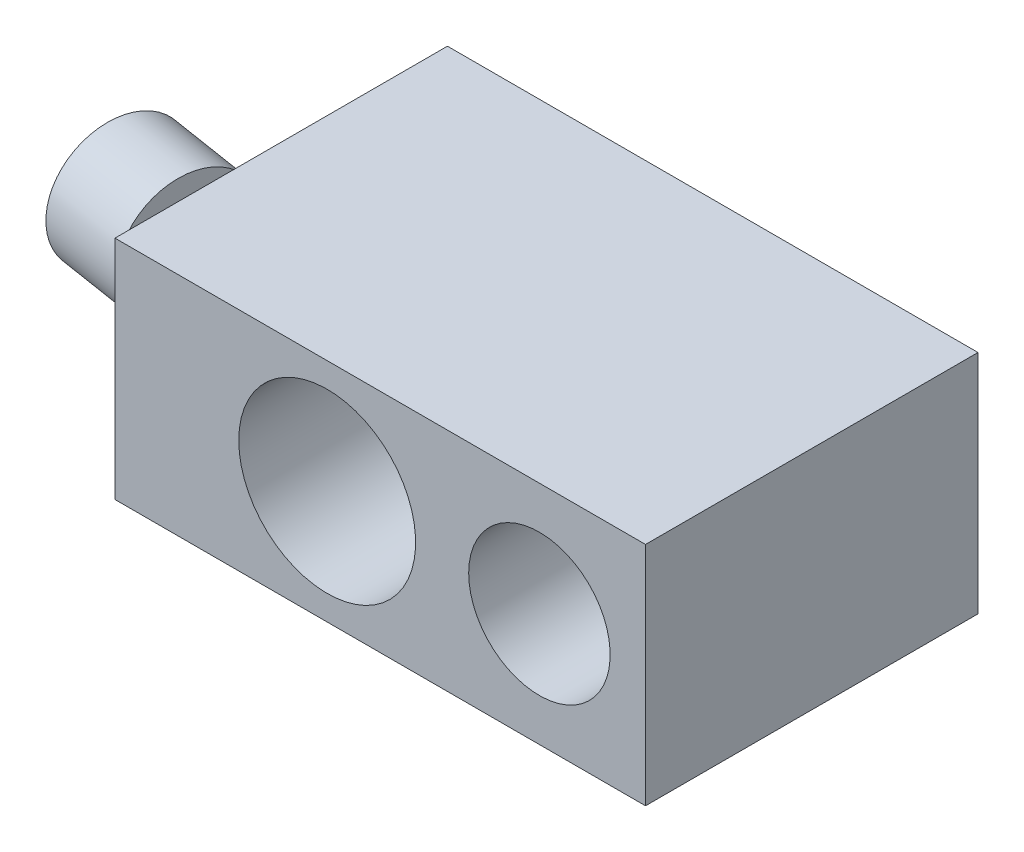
ISO-10303-21;
HEADER;
FILE_DESCRIPTION(('STEP AP214'),'2;1');
FILE_NAME('part.step','',(''),(''),'','','');
FILE_SCHEMA(('AUTOMOTIVE_DESIGN { 1 0 10303 214 1 1 1 1 }'));
ENDSEC;
DATA;
#1=APPLICATION_CONTEXT('core data for automotive mechanical design processes');
#2=APPLICATION_PROTOCOL_DEFINITION('international standard','automotive_design',2000,#1);
#3=PRODUCT_CONTEXT('',#1,'mechanical');
#4=PRODUCT('Part','Part','',(#3));
#5=PRODUCT_RELATED_PRODUCT_CATEGORY('part','',(#4));
#6=PRODUCT_DEFINITION_FORMATION('','',#4);
#7=PRODUCT_DEFINITION_CONTEXT('part definition',#1,'design');
#8=PRODUCT_DEFINITION('design','',#6,#7);
#9=PRODUCT_DEFINITION_SHAPE('','',#8);
#10=(LENGTH_UNIT() NAMED_UNIT(*) SI_UNIT(.MILLI.,.METRE.));
#11=(NAMED_UNIT(*) PLANE_ANGLE_UNIT() SI_UNIT($,.RADIAN.));
#12=(NAMED_UNIT(*) SI_UNIT($,.STERADIAN.) SOLID_ANGLE_UNIT());
#13=UNCERTAINTY_MEASURE_WITH_UNIT(LENGTH_MEASURE(1.E-05),#10,'distance_accuracy_value','');
#14=(GEOMETRIC_REPRESENTATION_CONTEXT(3) GLOBAL_UNCERTAINTY_ASSIGNED_CONTEXT((#13)) GLOBAL_UNIT_ASSIGNED_CONTEXT((#10,
#11,#12)) REPRESENTATION_CONTEXT('',''));
#15=CARTESIAN_POINT('',(0.,0.,0.));
#16=DIRECTION('',(0.,0.,1.));
#17=DIRECTION('',(1.,0.,0.));
#18=AXIS2_PLACEMENT_3D('',#15,#16,#17);
#19=CARTESIAN_POINT('',(-30.,-17.65,23.));
#20=DIRECTION('',(0.,1.,0.));
#21=DIRECTION('',(-1.,0.,0.));
#22=AXIS2_PLACEMENT_3D('',#19,#20,#21);
#23=PLANE('',#22);
#24=CARTESIAN_POINT('',(-30.,-17.65,22.));
#25=DIRECTION('',(0.,1.,0.));
#26=DIRECTION('',(-1.,0.,0.));
#27=AXIS2_PLACEMENT_3D('',#24,#25,#26);
#28=CIRCLE('',#27,1.925);
#29=CARTESIAN_POINT('',(-31.925,-17.65,22.));
#30=VERTEX_POINT('',#29);
#31=EDGE_CURVE('E196',#30,#30,#28,.T.);
#32=ORIENTED_EDGE('',*,*,#31,.F.);
#33=EDGE_LOOP('',(#32));
#34=FACE_BOUND('',#33,.T.);
#35=DIRECTION('',(0.866025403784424,0.,0.50000000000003));
#36=VECTOR('',#35,1.);
#37=CARTESIAN_POINT('',(-29.0669872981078,-17.65,21.3839745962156));
#38=LINE('',#37,#36);
#39=CARTESIAN_POINT('',(-30.,-17.65,20.8452994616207));
#40=VERTEX_POINT('',#39);
#41=CARTESIAN_POINT('',(-29.,-17.65,21.4226497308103));
#42=VERTEX_POINT('',#41);
#43=EDGE_CURVE('E11',#40,#42,#38,.T.);
#44=ORIENTED_EDGE('',*,*,#43,.F.);
#45=DIRECTION('',(0.866025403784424,0.,-0.50000000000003));
#46=VECTOR('',#45,1.);
#47=CARTESIAN_POINT('',(-30.9330127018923,-17.65,21.3839745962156));
#48=LINE('',#47,#46);
#49=CARTESIAN_POINT('',(-31.,-17.65,21.4226497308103));
#50=VERTEX_POINT('',#49);
#51=EDGE_CURVE('E205',#50,#40,#48,.T.);
#52=ORIENTED_EDGE('',*,*,#51,.F.);
#53=DIRECTION('',(0.,0.,-1.));
#54=VECTOR('',#53,1.);
#55=CARTESIAN_POINT('',(-31.,-17.65,23.));
#56=LINE('',#55,#54);
#57=CARTESIAN_POINT('',(-31.,-17.65,22.5773502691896));
#58=VERTEX_POINT('',#57);
#59=EDGE_CURVE('E201',#58,#50,#56,.T.);
#60=ORIENTED_EDGE('',*,*,#59,.F.);
#61=DIRECTION('',(-0.866025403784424,0.,-0.50000000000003));
#62=VECTOR('',#61,1.);
#63=CARTESIAN_POINT('',(-30.0669872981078,-17.65,23.1160254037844));
#64=LINE('',#63,#62);
#65=CARTESIAN_POINT('',(-30.,-17.65,23.1547005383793));
#66=VERTEX_POINT('',#65);
#67=EDGE_CURVE('E199',#66,#58,#64,.T.);
#68=ORIENTED_EDGE('',*,*,#67,.F.);
#69=DIRECTION('',(-0.866025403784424,0.,0.50000000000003));
#70=VECTOR('',#69,1.);
#71=CARTESIAN_POINT('',(-29.9330127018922,-17.65,23.1160254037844));
#72=LINE('',#71,#70);
#73=CARTESIAN_POINT('',(-29.,-17.65,22.5773502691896));
#74=VERTEX_POINT('',#73);
#75=EDGE_CURVE('E203',#74,#66,#72,.T.);
#76=ORIENTED_EDGE('',*,*,#75,.F.);
#77=DIRECTION('',(0.,0.,1.));
#78=VECTOR('',#77,1.);
#79=CARTESIAN_POINT('',(-29.,-17.65,23.));
#80=LINE('',#79,#78);
#81=EDGE_CURVE('E26',#42,#74,#80,.T.);
#82=ORIENTED_EDGE('',*,*,#81,.F.);
#83=EDGE_LOOP('',(#44,#52,#60,#68,#76,#82));
#84=FACE_BOUND('',#83,.T.);
#85=ADVANCED_FACE('F16',(#34,#84),#23,.F.);
#86=CARTESIAN_POINT('',(-30.,-15.5103137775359,22.));
#87=DIRECTION('',(0.,1.,0.));
#88=DIRECTION('',(-1.,0.,0.));
#89=AXIS2_PLACEMENT_3D('',#86,#87,#88);
#90=DEGENERATE_TOROIDAL_SURFACE('',#89,0.0423840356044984,2.84999999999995,.T.);
#91=ORIENTED_EDGE('',*,*,#31,.T.);
#92=EDGE_LOOP('',(#91));
#93=FACE_BOUND('',#92,.T.);
#94=CARTESIAN_POINT('',(-30.,-16.,22.));
#95=DIRECTION('',(0.,1.,0.));
#96=DIRECTION('',(-1.,0.,0.));
#97=AXIS2_PLACEMENT_3D('',#94,#95,#96);
#98=CIRCLE('',#97,2.85);
#99=CARTESIAN_POINT('',(-32.85,-16.,22.));
#100=VERTEX_POINT('',#99);
#101=EDGE_CURVE('E193',#100,#100,#98,.T.);
#102=ORIENTED_EDGE('',*,*,#101,.F.);
#103=EDGE_LOOP('',(#102));
#104=FACE_BOUND('',#103,.T.);
#105=ADVANCED_FACE('F378',(#93,#104),#90,.T.);
#106=CARTESIAN_POINT('',(-30.,-16.61,22.));
#107=DIRECTION('',(0.,1.,0.));
#108=DIRECTION('',(-1.,0.,0.));
#109=AXIS2_PLACEMENT_3D('',#106,#107,#108);
#110=PLANE('',#109);
#111=DIRECTION('',(0.,0.,1.));
#112=VECTOR('',#111,1.);
#113=CARTESIAN_POINT('',(-31.,-16.61,21.4226497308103));
#114=LINE('',#113,#112);
#115=CARTESIAN_POINT('',(-31.,-16.61,21.4226497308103));
#116=VERTEX_POINT('',#115);
#117=CARTESIAN_POINT('',(-31.,-16.61,22.5773502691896));
#118=VERTEX_POINT('',#117);
#119=EDGE_CURVE('E172',#116,#118,#114,.T.);
#120=ORIENTED_EDGE('',*,*,#119,.F.);
#121=DIRECTION('',(-0.866025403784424,0.,0.50000000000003));
#122=VECTOR('',#121,1.);
#123=CARTESIAN_POINT('',(-30.,-16.61,20.8452994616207));
#124=LINE('',#123,#122);
#125=CARTESIAN_POINT('',(-30.,-16.61,20.8452994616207));
#126=VERTEX_POINT('',#125);
#127=EDGE_CURVE('E169',#126,#116,#124,.T.);
#128=ORIENTED_EDGE('',*,*,#127,.F.);
#129=DIRECTION('',(-0.866025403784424,0.,-0.50000000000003));
#130=VECTOR('',#129,1.);
#131=CARTESIAN_POINT('',(-29.,-16.61,21.4226497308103));
#132=LINE('',#131,#130);
#133=CARTESIAN_POINT('',(-29.,-16.61,21.4226497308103));
#134=VERTEX_POINT('',#133);
#135=EDGE_CURVE('E164',#134,#126,#132,.T.);
#136=ORIENTED_EDGE('',*,*,#135,.F.);
#137=DIRECTION('',(0.,0.,-1.));
#138=VECTOR('',#137,1.);
#139=CARTESIAN_POINT('',(-29.,-16.61,22.5773502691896));
#140=LINE('',#139,#138);
#141=CARTESIAN_POINT('',(-29.,-16.61,22.5773502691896));
#142=VERTEX_POINT('',#141);
#143=EDGE_CURVE('E157',#142,#134,#140,.T.);
#144=ORIENTED_EDGE('',*,*,#143,.F.);
#145=DIRECTION('',(0.866025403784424,0.,-0.50000000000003));
#146=VECTOR('',#145,1.);
#147=CARTESIAN_POINT('',(-30.,-16.61,23.1547005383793));
#148=LINE('',#147,#146);
#149=CARTESIAN_POINT('',(-30.,-16.61,23.1547005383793));
#150=VERTEX_POINT('',#149);
#151=EDGE_CURVE('E35',#150,#142,#148,.T.);
#152=ORIENTED_EDGE('',*,*,#151,.F.);
#153=DIRECTION('',(0.866025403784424,0.,0.50000000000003));
#154=VECTOR('',#153,1.);
#155=CARTESIAN_POINT('',(-31.,-16.61,22.5773502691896));
#156=LINE('',#155,#154);
#157=EDGE_CURVE('E174',#118,#150,#156,.T.);
#158=ORIENTED_EDGE('',*,*,#157,.F.);
#159=EDGE_LOOP('',(#120,#128,#136,#144,#152,#158));
#160=FACE_BOUND('',#159,.T.);
#161=ADVANCED_FACE('F382',(#160),#110,.F.);
#162=CARTESIAN_POINT('',(-30.,-16.61,23.1547005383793));
#163=DIRECTION('',(-0.50000000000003,0.,-0.866025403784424));
#164=DIRECTION('',(-0.866025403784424,0.,0.50000000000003));
#165=AXIS2_PLACEMENT_3D('',#162,#163,#164);
#166=PLANE('',#165);
#167=DIRECTION('',(0.,-1.,0.));
#168=VECTOR('',#167,1.);
#169=CARTESIAN_POINT('',(-30.,-16.61,23.1547005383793));
#170=LINE('',#169,#168);
#171=EDGE_CURVE('E176',#150,#66,#170,.T.);
#172=ORIENTED_EDGE('',*,*,#171,.F.);
#173=ORIENTED_EDGE('',*,*,#151,.T.);
#174=DIRECTION('',(0.,-1.,0.));
#175=VECTOR('',#174,1.);
#176=CARTESIAN_POINT('',(-29.,-16.61,22.5773502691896));
#177=LINE('',#176,#175);
#178=EDGE_CURVE('E191',#142,#74,#177,.T.);
#179=ORIENTED_EDGE('',*,*,#178,.T.);
#180=ORIENTED_EDGE('',*,*,#75,.T.);
#181=EDGE_LOOP('',(#172,#173,#179,#180));
#182=FACE_BOUND('',#181,.T.);
#183=ADVANCED_FACE('F384',(#182),#166,.T.);
#184=CARTESIAN_POINT('',(-29.,-16.61,22.5773502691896));
#185=DIRECTION('',(-1.,0.,0.));
#186=DIRECTION('',(0.,-1.,0.));
#187=AXIS2_PLACEMENT_3D('',#184,#185,#186);
#188=PLANE('',#187);
#189=ORIENTED_EDGE('',*,*,#178,.F.);
#190=ORIENTED_EDGE('',*,*,#143,.T.);
#191=DIRECTION('',(0.,-1.,0.));
#192=VECTOR('',#191,1.);
#193=CARTESIAN_POINT('',(-29.,-16.61,21.4226497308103));
#194=LINE('',#193,#192);
#195=EDGE_CURVE('E188',#134,#42,#194,.T.);
#196=ORIENTED_EDGE('',*,*,#195,.T.);
#197=ORIENTED_EDGE('',*,*,#81,.T.);
#198=EDGE_LOOP('',(#189,#190,#196,#197));
#199=FACE_BOUND('',#198,.T.);
#200=ADVANCED_FACE('F387',(#199),#188,.T.);
#201=CARTESIAN_POINT('',(-29.,-16.61,21.4226497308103));
#202=DIRECTION('',(-0.50000000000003,0.,0.866025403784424));
#203=DIRECTION('',(0.866025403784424,0.,0.50000000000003));
#204=AXIS2_PLACEMENT_3D('',#201,#202,#203);
#205=PLANE('',#204);
#206=ORIENTED_EDGE('',*,*,#195,.F.);
#207=ORIENTED_EDGE('',*,*,#135,.T.);
#208=DIRECTION('',(0.,-1.,0.));
#209=VECTOR('',#208,1.);
#210=CARTESIAN_POINT('',(-30.,-16.61,20.8452994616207));
#211=LINE('',#210,#209);
#212=EDGE_CURVE('E185',#126,#40,#211,.T.);
#213=ORIENTED_EDGE('',*,*,#212,.T.);
#214=ORIENTED_EDGE('',*,*,#43,.T.);
#215=EDGE_LOOP('',(#206,#207,#213,#214));
#216=FACE_BOUND('',#215,.T.);
#217=ADVANCED_FACE('F390',(#216),#205,.T.);
#218=CARTESIAN_POINT('',(-30.,-16.61,20.8452994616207));
#219=DIRECTION('',(0.50000000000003,0.,0.866025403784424));
#220=DIRECTION('',(0.866025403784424,0.,-0.50000000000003));
#221=AXIS2_PLACEMENT_3D('',#218,#219,#220);
#222=PLANE('',#221);
#223=ORIENTED_EDGE('',*,*,#212,.F.);
#224=ORIENTED_EDGE('',*,*,#127,.T.);
#225=DIRECTION('',(0.,-1.,0.));
#226=VECTOR('',#225,1.);
#227=CARTESIAN_POINT('',(-31.,-16.61,21.4226497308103));
#228=LINE('',#227,#226);
#229=EDGE_CURVE('E182',#116,#50,#228,.T.);
#230=ORIENTED_EDGE('',*,*,#229,.T.);
#231=ORIENTED_EDGE('',*,*,#51,.T.);
#232=EDGE_LOOP('',(#223,#224,#230,#231));
#233=FACE_BOUND('',#232,.T.);
#234=ADVANCED_FACE('F394',(#233),#222,.T.);
#235=CARTESIAN_POINT('',(-31.,-16.61,21.4226497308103));
#236=DIRECTION('',(1.,0.,0.));
#237=DIRECTION('',(0.,1.,0.));
#238=AXIS2_PLACEMENT_3D('',#235,#236,#237);
#239=PLANE('',#238);
#240=ORIENTED_EDGE('',*,*,#119,.T.);
#241=DIRECTION('',(0.,-1.,0.));
#242=VECTOR('',#241,1.);
#243=CARTESIAN_POINT('',(-31.,-16.61,22.5773502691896));
#244=LINE('',#243,#242);
#245=EDGE_CURVE('E179',#118,#58,#244,.T.);
#246=ORIENTED_EDGE('',*,*,#245,.T.);
#247=ORIENTED_EDGE('',*,*,#59,.T.);
#248=ORIENTED_EDGE('',*,*,#229,.F.);
#249=EDGE_LOOP('',(#240,#246,#247,#248));
#250=FACE_BOUND('',#249,.T.);
#251=ADVANCED_FACE('F398',(#250),#239,.T.);
#252=CARTESIAN_POINT('',(-31.,-16.61,22.5773502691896));
#253=DIRECTION('',(0.50000000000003,0.,-0.866025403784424));
#254=DIRECTION('',(-0.866025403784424,0.,-0.50000000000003));
#255=AXIS2_PLACEMENT_3D('',#252,#253,#254);
#256=PLANE('',#255);
#257=ORIENTED_EDGE('',*,*,#245,.F.);
#258=ORIENTED_EDGE('',*,*,#157,.T.);
#259=ORIENTED_EDGE('',*,*,#171,.T.);
#260=ORIENTED_EDGE('',*,*,#67,.T.);
#261=EDGE_LOOP('',(#257,#258,#259,#260));
#262=FACE_BOUND('',#261,.T.);
#263=ADVANCED_FACE('F374',(#262),#256,.T.);
#264=CARTESIAN_POINT('',(-74.883787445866,-2.88675134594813,20.8803140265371));
#265=DIRECTION('',(0.987688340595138,0.,0.156434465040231));
#266=DIRECTION('',(-0.156434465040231,0.,0.987688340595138));
#267=AXIS2_PLACEMENT_3D('',#264,#265,#266);
#268=PLANE('',#267);
#269=DIRECTION('',(-0.135476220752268,-0.5,0.855363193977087));
#270=VECTOR('',#269,1.);
#271=CARTESIAN_POINT('',(-74.883787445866,-2.88675134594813,20.8803140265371));
#272=LINE('',#271,#270);
#273=CARTESIAN_POINT('',(-74.883787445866,-2.88675134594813,20.8803140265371));
#274=VERTEX_POINT('',#273);
#275=CARTESIAN_POINT('',(-75.6659597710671,-5.77350269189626,25.8187557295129));
#276=VERTEX_POINT('',#275);
#277=EDGE_CURVE('E226',#274,#276,#272,.T.);
#278=ORIENTED_EDGE('',*,*,#277,.T.);
#279=DIRECTION('',(-0.135476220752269,0.5,0.855363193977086));
#280=VECTOR('',#279,1.);
#281=CARTESIAN_POINT('',(-75.6659597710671,-5.77350269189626,25.8187557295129));
#282=LINE('',#281,#280);
#283=CARTESIAN_POINT('',(-76.4481320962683,-2.88675134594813,30.7571974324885));
#284=VERTEX_POINT('',#283);
#285=EDGE_CURVE('E229',#276,#284,#282,.T.);
#286=ORIENTED_EDGE('',*,*,#285,.T.);
#287=DIRECTION('',(0.,1.,0.));
#288=VECTOR('',#287,1.);
#289=CARTESIAN_POINT('',(-76.4481320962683,-2.88675134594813,30.7571974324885));
#290=LINE('',#289,#288);
#291=CARTESIAN_POINT('',(-76.4481320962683,2.88675134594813,30.7571974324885));
#292=VERTEX_POINT('',#291);
#293=EDGE_CURVE('E232',#284,#292,#290,.T.);
#294=ORIENTED_EDGE('',*,*,#293,.T.);
#295=DIRECTION('',(0.135476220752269,0.5,-0.855363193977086));
#296=VECTOR('',#295,1.);
#297=CARTESIAN_POINT('',(-76.4481320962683,2.88675134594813,30.7571974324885));
#298=LINE('',#297,#296);
#299=CARTESIAN_POINT('',(-75.6659597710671,5.77350269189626,25.8187557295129));
#300=VERTEX_POINT('',#299);
#301=EDGE_CURVE('E235',#292,#300,#298,.T.);
#302=ORIENTED_EDGE('',*,*,#301,.T.);
#303=DIRECTION('',(0.135476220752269,-0.5,-0.855363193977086));
#304=VECTOR('',#303,1.);
#305=CARTESIAN_POINT('',(-75.6659597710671,5.77350269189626,25.8187557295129));
#306=LINE('',#305,#304);
#307=CARTESIAN_POINT('',(-74.883787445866,2.88675134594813,20.8803140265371));
#308=VERTEX_POINT('',#307);
#309=EDGE_CURVE('E238',#300,#308,#306,.T.);
#310=ORIENTED_EDGE('',*,*,#309,.T.);
#311=DIRECTION('',(0.,-1.,0.));
#312=VECTOR('',#311,1.);
#313=CARTESIAN_POINT('',(-74.883787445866,2.88675134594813,20.8803140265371));
#314=LINE('',#313,#312);
#315=EDGE_CURVE('E241',#308,#274,#314,.T.);
#316=ORIENTED_EDGE('',*,*,#315,.T.);
#317=EDGE_LOOP('',(#278,#286,#294,#302,#310,#316));
#318=FACE_BOUND('',#317,.T.);
#319=ADVANCED_FACE('F356',(#318),#268,.F.);
#320=CARTESIAN_POINT('',(-76.4481320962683,-2.88675134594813,30.7571974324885));
#321=DIRECTION('',(-0.156434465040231,0.,0.987688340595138));
#322=DIRECTION('',(-0.987688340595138,0.,-0.156434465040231));
#323=AXIS2_PLACEMENT_3D('',#320,#321,#322);
#324=PLANE('',#323);
#325=DIRECTION('',(0.,1.,0.));
#326=VECTOR('',#325,1.);
#327=CARTESIAN_POINT('',(-82.3742621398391,-2.88675134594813,29.8185906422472));
#328=LINE('',#327,#326);
#329=CARTESIAN_POINT('',(-82.3742621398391,-2.88675134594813,29.8185906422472));
#330=VERTEX_POINT('',#329);
#331=CARTESIAN_POINT('',(-82.3742621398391,2.88675134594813,29.8185906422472));
#332=VERTEX_POINT('',#331);
#333=EDGE_CURVE('E214',#330,#332,#328,.T.);
#334=ORIENTED_EDGE('',*,*,#333,.T.);
#335=DIRECTION('',(-0.987688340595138,0.,-0.156434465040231));
#336=VECTOR('',#335,1.);
#337=CARTESIAN_POINT('',(-76.4481320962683,2.88675134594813,30.7571974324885));
#338=LINE('',#337,#336);
#339=EDGE_CURVE('E252',#292,#332,#338,.T.);
#340=ORIENTED_EDGE('',*,*,#339,.F.);
#341=ORIENTED_EDGE('',*,*,#293,.F.);
#342=DIRECTION('',(-0.987688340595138,0.,-0.156434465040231));
#343=VECTOR('',#342,1.);
#344=CARTESIAN_POINT('',(-76.4481320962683,-2.88675134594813,30.7571974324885));
#345=LINE('',#344,#343);
#346=EDGE_CURVE('E254',#284,#330,#345,.T.);
#347=ORIENTED_EDGE('',*,*,#346,.T.);
#348=EDGE_LOOP('',(#334,#340,#341,#347));
#349=FACE_BOUND('',#348,.T.);
#350=ADVANCED_FACE('F357',(#349),#324,.F.);
#351=CARTESIAN_POINT('',(-76.4481320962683,2.88675134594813,30.7571974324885));
#352=DIRECTION('',(-0.0782172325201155,0.866025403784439,0.493844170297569));
#353=DIRECTION('',(0.,0.4953617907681,-0.868686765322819));
#354=AXIS2_PLACEMENT_3D('',#351,#352,#353);
#355=PLANE('',#354);
#356=DIRECTION('',(0.135476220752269,0.5,-0.855363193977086));
#357=VECTOR('',#356,1.);
#358=CARTESIAN_POINT('',(-82.3742621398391,2.88675134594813,29.8185906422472));
#359=LINE('',#358,#357);
#360=CARTESIAN_POINT('',(-81.592089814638,5.77350269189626,24.8801489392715));
#361=VERTEX_POINT('',#360);
#362=EDGE_CURVE('E217',#332,#361,#359,.T.);
#363=ORIENTED_EDGE('',*,*,#362,.T.);
#364=DIRECTION('',(-0.987688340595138,0.,-0.156434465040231));
#365=VECTOR('',#364,1.);
#366=CARTESIAN_POINT('',(-75.6659597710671,5.77350269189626,25.8187557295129));
#367=LINE('',#366,#365);
#368=EDGE_CURVE('E250',#300,#361,#367,.T.);
#369=ORIENTED_EDGE('',*,*,#368,.F.);
#370=ORIENTED_EDGE('',*,*,#301,.F.);
#371=ORIENTED_EDGE('',*,*,#339,.T.);
#372=EDGE_LOOP('',(#363,#369,#370,#371));
#373=FACE_BOUND('',#372,.T.);
#374=ADVANCED_FACE('F364',(#373),#355,.F.);
#375=CARTESIAN_POINT('',(-75.6659597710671,5.77350269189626,25.8187557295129));
#376=DIRECTION('',(0.0782172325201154,0.866025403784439,-0.493844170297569));
#377=DIRECTION('',(0.,-0.4953617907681,-0.868686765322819));
#378=AXIS2_PLACEMENT_3D('',#375,#376,#377);
#379=PLANE('',#378);
#380=DIRECTION('',(0.135476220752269,-0.5,-0.855363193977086));
#381=VECTOR('',#380,1.);
#382=CARTESIAN_POINT('',(-81.592089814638,5.77350269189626,24.8801489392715));
#383=LINE('',#382,#381);
#384=CARTESIAN_POINT('',(-80.8099174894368,2.88675134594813,19.9417072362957));
#385=VERTEX_POINT('',#384);
#386=EDGE_CURVE('E220',#361,#385,#383,.T.);
#387=ORIENTED_EDGE('',*,*,#386,.T.);
#388=DIRECTION('',(-0.987688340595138,0.,-0.156434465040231));
#389=VECTOR('',#388,1.);
#390=CARTESIAN_POINT('',(-74.883787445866,2.88675134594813,20.8803140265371));
#391=LINE('',#390,#389);
#392=EDGE_CURVE('E248',#308,#385,#391,.T.);
#393=ORIENTED_EDGE('',*,*,#392,.F.);
#394=ORIENTED_EDGE('',*,*,#309,.F.);
#395=ORIENTED_EDGE('',*,*,#368,.T.);
#396=EDGE_LOOP('',(#387,#393,#394,#395));
#397=FACE_BOUND('',#396,.T.);
#398=ADVANCED_FACE('F358',(#397),#379,.F.);
#399=CARTESIAN_POINT('',(-74.883787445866,2.88675134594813,20.8803140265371));
#400=DIRECTION('',(0.156434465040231,0.,-0.987688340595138));
#401=DIRECTION('',(0.987688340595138,0.,0.156434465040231));
#402=AXIS2_PLACEMENT_3D('',#399,#400,#401);
#403=PLANE('',#402);
#404=DIRECTION('',(0.,-1.,0.));
#405=VECTOR('',#404,1.);
#406=CARTESIAN_POINT('',(-80.8099174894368,2.88675134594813,19.9417072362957));
#407=LINE('',#406,#405);
#408=CARTESIAN_POINT('',(-80.8099174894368,-2.88675134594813,19.9417072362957));
#409=VERTEX_POINT('',#408);
#410=EDGE_CURVE('E223',#385,#409,#407,.T.);
#411=ORIENTED_EDGE('',*,*,#410,.T.);
#412=DIRECTION('',(-0.987688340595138,0.,-0.156434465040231));
#413=VECTOR('',#412,1.);
#414=CARTESIAN_POINT('',(-74.883787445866,-2.88675134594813,20.8803140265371));
#415=LINE('',#414,#413);
#416=EDGE_CURVE('E245',#274,#409,#415,.T.);
#417=ORIENTED_EDGE('',*,*,#416,.F.);
#418=ORIENTED_EDGE('',*,*,#315,.F.);
#419=ORIENTED_EDGE('',*,*,#392,.T.);
#420=EDGE_LOOP('',(#411,#417,#418,#419));
#421=FACE_BOUND('',#420,.T.);
#422=ADVANCED_FACE('F346',(#421),#403,.F.);
#423=CARTESIAN_POINT('',(-74.883787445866,-2.88675134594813,20.8803140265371));
#424=DIRECTION('',(0.0782172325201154,-0.866025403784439,-0.493844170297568));
#425=DIRECTION('',(0.,-0.495361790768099,0.868686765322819));
#426=AXIS2_PLACEMENT_3D('',#423,#424,#425);
#427=PLANE('',#426);
#428=DIRECTION('',(-0.135476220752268,-0.5,0.855363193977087));
#429=VECTOR('',#428,1.);
#430=CARTESIAN_POINT('',(-80.8099174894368,-2.88675134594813,19.9417072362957));
#431=LINE('',#430,#429);
#432=CARTESIAN_POINT('',(-81.5920898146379,-5.77350269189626,24.8801489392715));
#433=VERTEX_POINT('',#432);
#434=EDGE_CURVE('E208',#409,#433,#431,.T.);
#435=ORIENTED_EDGE('',*,*,#434,.T.);
#436=DIRECTION('',(-0.987688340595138,0.,-0.156434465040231));
#437=VECTOR('',#436,1.);
#438=CARTESIAN_POINT('',(-75.6659597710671,-5.77350269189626,25.8187557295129));
#439=LINE('',#438,#437);
#440=EDGE_CURVE('E244',#276,#433,#439,.T.);
#441=ORIENTED_EDGE('',*,*,#440,.F.);
#442=ORIENTED_EDGE('',*,*,#277,.F.);
#443=ORIENTED_EDGE('',*,*,#416,.T.);
#444=EDGE_LOOP('',(#435,#441,#442,#443));
#445=FACE_BOUND('',#444,.T.);
#446=ADVANCED_FACE('F341',(#445),#427,.F.);
#447=CARTESIAN_POINT('',(-75.6659597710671,-5.77350269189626,25.8187557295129));
#448=DIRECTION('',(-0.0782172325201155,-0.866025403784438,0.493844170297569));
#449=DIRECTION('',(0.,0.4953617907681,0.868686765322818));
#450=AXIS2_PLACEMENT_3D('',#447,#448,#449);
#451=PLANE('',#450);
#452=DIRECTION('',(-0.135476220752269,0.5,0.855363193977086));
#453=VECTOR('',#452,1.);
#454=CARTESIAN_POINT('',(-81.592089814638,-5.77350269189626,24.8801489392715));
#455=LINE('',#454,#453);
#456=EDGE_CURVE('E211',#433,#330,#455,.T.);
#457=ORIENTED_EDGE('',*,*,#456,.T.);
#458=ORIENTED_EDGE('',*,*,#346,.F.);
#459=ORIENTED_EDGE('',*,*,#285,.F.);
#460=ORIENTED_EDGE('',*,*,#440,.T.);
#461=EDGE_LOOP('',(#457,#458,#459,#460));
#462=FACE_BOUND('',#461,.T.);
#463=ADVANCED_FACE('F334',(#462),#451,.F.);
#464=CARTESIAN_POINT('',(-83.,0.,33.7693440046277));
#465=DIRECTION('',(0.987688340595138,0.,0.156434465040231));
#466=DIRECTION('',(-0.156434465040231,0.,0.987688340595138));
#467=AXIS2_PLACEMENT_3D('',#464,#465,#466);
#468=PLANE('',#467);
#469=ORIENTED_EDGE('',*,*,#456,.F.);
#470=ORIENTED_EDGE('',*,*,#434,.F.);
#471=ORIENTED_EDGE('',*,*,#410,.F.);
#472=ORIENTED_EDGE('',*,*,#386,.F.);
#473=ORIENTED_EDGE('',*,*,#362,.F.);
#474=ORIENTED_EDGE('',*,*,#333,.F.);
#475=EDGE_LOOP('',(#469,#470,#471,#472,#473,#474));
#476=FACE_BOUND('',#475,.T.);
#477=CARTESIAN_POINT('',(-81.5920898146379,0.,24.8801489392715));
#478=DIRECTION('',(-0.987688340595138,0.,-0.156434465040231));
#479=DIRECTION('',(0.156434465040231,0.,-0.987688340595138));
#480=AXIS2_PLACEMENT_3D('',#477,#478,#479);
#481=CIRCLE('',#480,9.);
#482=CARTESIAN_POINT('',(-80.1841796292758,0.,15.9909538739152));
#483=VERTEX_POINT('',#482);
#484=EDGE_CURVE('E247',#483,#483,#481,.T.);
#485=ORIENTED_EDGE('',*,*,#484,.T.);
#486=EDGE_LOOP('',(#485));
#487=FACE_BOUND('',#486,.T.);
#488=ADVANCED_FACE('F314',(#476,#487),#468,.F.);
#489=CARTESIAN_POINT('',(-71.,0.,26.5577711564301));
#490=DIRECTION('',(-0.987688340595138,0.,-0.156434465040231));
#491=DIRECTION('',(0.156434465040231,0.,-0.987688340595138));
#492=AXIS2_PLACEMENT_3D('',#489,#490,#491);
#493=CYLINDRICAL_SURFACE('',#492,9.);
#494=CARTESIAN_POINT('',(-69.7398297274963,0.,26.7573625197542));
#495=DIRECTION('',(-0.987688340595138,0.,-0.156434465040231));
#496=DIRECTION('',(0.156434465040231,0.,-0.987688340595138));
#497=AXIS2_PLACEMENT_3D('',#494,#495,#496);
#498=CIRCLE('',#497,9.);
#499=CARTESIAN_POINT('',(-68.3319195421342,0.,17.868167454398));
#500=VERTEX_POINT('',#499);
#501=EDGE_CURVE('E263',#500,#500,#498,.T.);
#502=ORIENTED_EDGE('',*,*,#501,.T.);
#503=EDGE_LOOP('',(#502));
#504=FACE_BOUND('',#503,.T.);
#505=ORIENTED_EDGE('',*,*,#484,.F.);
#506=EDGE_LOOP('',(#505));
#507=FACE_BOUND('',#506,.T.);
#508=ADVANCED_FACE('F323',(#504,#507),#493,.T.);
#509=CARTESIAN_POINT('',(-71.1477399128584,0.,35.6465575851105));
#510=DIRECTION('',(0.987688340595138,0.,0.156434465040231));
#511=DIRECTION('',(-0.156434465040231,0.,0.987688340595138));
#512=AXIS2_PLACEMENT_3D('',#509,#510,#511);
#513=PLANE('',#512);
#514=CARTESIAN_POINT('',(-69.7398297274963,0.,26.7573625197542));
#515=DIRECTION('',(-0.987688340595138,0.,-0.156434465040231));
#516=DIRECTION('',(0.156434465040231,0.,-0.987688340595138));
#517=AXIS2_PLACEMENT_3D('',#514,#515,#516);
#518=CIRCLE('',#517,6.);
#519=CARTESIAN_POINT('',(-68.8012229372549,0.,20.8312324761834));
#520=VERTEX_POINT('',#519);
#521=EDGE_CURVE('E260',#520,#520,#518,.T.);
#522=ORIENTED_EDGE('',*,*,#521,.T.);
#523=EDGE_LOOP('',(#522));
#524=FACE_BOUND('',#523,.T.);
#525=ORIENTED_EDGE('',*,*,#501,.F.);
#526=EDGE_LOOP('',(#525));
#527=FACE_BOUND('',#526,.T.);
#528=ADVANCED_FACE('F315',(#524,#527),#513,.T.);
#529=CARTESIAN_POINT('',(-34.,0.,7.));
#530=DIRECTION('',(0.,0.,1.));
#531=DIRECTION('',(-1.,0.,0.));
#532=AXIS2_PLACEMENT_3D('',#529,#530,#531);
#533=PLANE('',#532);
#534=CARTESIAN_POINT('',(-30.,0.,7.));
#535=DIRECTION('',(0.,0.,1.));
#536=DIRECTION('',(-1.,0.,0.));
#537=AXIS2_PLACEMENT_3D('',#534,#535,#536);
#538=CIRCLE('',#537,12.5);
#539=CARTESIAN_POINT('',(-42.5,0.,7.));
#540=VERTEX_POINT('',#539);
#541=EDGE_CURVE('E266',#540,#540,#538,.T.);
#542=ORIENTED_EDGE('',*,*,#541,.T.);
#543=EDGE_LOOP('',(#542));
#544=FACE_BOUND('',#543,.T.);
#545=ADVANCED_FACE('F316',(#544),#533,.T.);
#546=CARTESIAN_POINT('',(-7.,0.,27.));
#547=DIRECTION('',(0.,0.,1.));
#548=DIRECTION('',(-1.,0.,0.));
#549=AXIS2_PLACEMENT_3D('',#546,#547,#548);
#550=PLANE('',#549);
#551=CARTESIAN_POINT('',(0.,0.,27.));
#552=DIRECTION('',(0.,0.,1.));
#553=DIRECTION('',(-1.,0.,0.));
#554=AXIS2_PLACEMENT_3D('',#551,#552,#553);
#555=CIRCLE('',#554,10.);
#556=CARTESIAN_POINT('',(-10.,0.,27.));
#557=VERTEX_POINT('',#556);
#558=EDGE_CURVE('E278',#557,#557,#555,.T.);
#559=ORIENTED_EDGE('',*,*,#558,.T.);
#560=EDGE_LOOP('',(#559));
#561=FACE_BOUND('',#560,.T.);
#562=CARTESIAN_POINT('',(0.,0.,27.));
#563=DIRECTION('',(0.,0.,1.));
#564=DIRECTION('',(-1.,0.,0.));
#565=AXIS2_PLACEMENT_3D('',#562,#563,#564);
#566=CIRCLE('',#565,7.);
#567=CARTESIAN_POINT('',(-7.,0.,27.));
#568=VERTEX_POINT('',#567);
#569=EDGE_CURVE('E275',#568,#568,#566,.T.);
#570=ORIENTED_EDGE('',*,*,#569,.F.);
#571=EDGE_LOOP('',(#570));
#572=FACE_BOUND('',#571,.T.);
#573=ADVANCED_FACE('F303',(#561,#572),#550,.T.);
#574=CARTESIAN_POINT('',(0.,0.,47.));
#575=DIRECTION('',(0.,0.,1.));
#576=DIRECTION('',(-1.,0.,0.));
#577=AXIS2_PLACEMENT_3D('',#574,#575,#576);
#578=CYLINDRICAL_SURFACE('',#577,7.);
#579=ORIENTED_EDGE('',*,*,#569,.T.);
#580=EDGE_LOOP('',(#579));
#581=FACE_BOUND('',#580,.T.);
#582=CARTESIAN_POINT('',(0.,0.,0.));
#583=DIRECTION('',(0.,0.,1.));
#584=DIRECTION('',(-1.,0.,0.));
#585=AXIS2_PLACEMENT_3D('',#582,#583,#584);
#586=CIRCLE('',#585,7.);
#587=CARTESIAN_POINT('',(-7.,0.,0.));
#588=VERTEX_POINT('',#587);
#589=EDGE_CURVE('E272',#588,#588,#586,.T.);
#590=ORIENTED_EDGE('',*,*,#589,.F.);
#591=EDGE_LOOP('',(#590));
#592=FACE_BOUND('',#591,.T.);
#593=ADVANCED_FACE('F300',(#581,#592),#578,.F.);
#594=CARTESIAN_POINT('',(-71.,0.,26.5577711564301));
#595=DIRECTION('',(-0.987688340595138,0.,-0.156434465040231));
#596=DIRECTION('',(0.156434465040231,0.,-0.987688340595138));
#597=AXIS2_PLACEMENT_3D('',#594,#595,#596);
#598=CYLINDRICAL_SURFACE('',#597,6.);
#599=CARTESIAN_POINT('',(-60.,0.,28.3));
#600=DIRECTION('',(-1.,0.,0.));
#601=DIRECTION('',(0.,0.,-1.));
#602=AXIS2_PLACEMENT_3D('',#599,#600,#601);
#603=ELLIPSE('',#602,6.07479075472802,6.);
#604=CARTESIAN_POINT('',(-60.,0.,22.225209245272));
#605=VERTEX_POINT('',#604);
#606=EDGE_CURVE('E20',#605,#605,#603,.T.);
#607=ORIENTED_EDGE('',*,*,#606,.T.);
#608=EDGE_LOOP('',(#607));
#609=FACE_BOUND('',#608,.T.);
#610=ORIENTED_EDGE('',*,*,#521,.F.);
#611=EDGE_LOOP('',(#610));
#612=FACE_BOUND('',#611,.T.);
#613=ADVANCED_FACE('F302',(#609,#612),#598,.T.);
#614=CARTESIAN_POINT('',(-30.,0.,47.));
#615=DIRECTION('',(0.,0.,1.));
#616=DIRECTION('',(-1.,0.,0.));
#617=AXIS2_PLACEMENT_3D('',#614,#615,#616);
#618=CYLINDRICAL_SURFACE('',#617,12.5);
#619=CARTESIAN_POINT('',(-30.,0.,47.));
#620=DIRECTION('',(0.,0.,1.));
#621=DIRECTION('',(-1.,0.,0.));
#622=AXIS2_PLACEMENT_3D('',#619,#620,#621);
#623=CIRCLE('',#622,12.5);
#624=CARTESIAN_POINT('',(-42.5,0.,47.));
#625=VERTEX_POINT('',#624);
#626=EDGE_CURVE('E269',#625,#625,#623,.T.);
#627=ORIENTED_EDGE('',*,*,#626,.T.);
#628=EDGE_LOOP('',(#627));
#629=FACE_BOUND('',#628,.T.);
#630=ORIENTED_EDGE('',*,*,#541,.F.);
#631=EDGE_LOOP('',(#630));
#632=FACE_BOUND('',#631,.T.);
#633=ADVANCED_FACE('F306',(#629,#632),#618,.F.);
#634=CARTESIAN_POINT('',(-60.,16.,47.));
#635=DIRECTION('',(0.,1.,0.));
#636=DIRECTION('',(-1.,0.,0.));
#637=AXIS2_PLACEMENT_3D('',#634,#635,#636);
#638=PLANE('',#637);
#639=DIRECTION('',(0.,0.,-1.));
#640=VECTOR('',#639,1.);
#641=CARTESIAN_POINT('',(-60.,16.,47.));
#642=LINE('',#641,#640);
#643=CARTESIAN_POINT('',(-60.,16.,47.));
#644=VERTEX_POINT('',#643);
#645=CARTESIAN_POINT('',(-60.,16.,0.));
#646=VERTEX_POINT('',#645);
#647=EDGE_CURVE('E129',#644,#646,#642,.T.);
#648=ORIENTED_EDGE('',*,*,#647,.F.);
#649=DIRECTION('',(1.,0.,0.));
#650=VECTOR('',#649,1.);
#651=CARTESIAN_POINT('',(-60.,16.,47.));
#652=LINE('',#651,#650);
#653=CARTESIAN_POINT('',(15.,16.,47.));
#654=VERTEX_POINT('',#653);
#655=EDGE_CURVE('E143',#644,#654,#652,.T.);
#656=ORIENTED_EDGE('',*,*,#655,.T.);
#657=DIRECTION('',(0.,0.,-1.));
#658=VECTOR('',#657,1.);
#659=CARTESIAN_POINT('',(15.,16.,47.));
#660=LINE('',#659,#658);
#661=CARTESIAN_POINT('',(15.,16.,0.));
#662=VERTEX_POINT('',#661);
#663=EDGE_CURVE('E150',#654,#662,#660,.T.);
#664=ORIENTED_EDGE('',*,*,#663,.T.);
#665=DIRECTION('',(1.,0.,0.));
#666=VECTOR('',#665,1.);
#667=CARTESIAN_POINT('',(-60.,16.,0.));
#668=LINE('',#667,#666);
#669=EDGE_CURVE('E284',#646,#662,#668,.T.);
#670=ORIENTED_EDGE('',*,*,#669,.F.);
#671=EDGE_LOOP('',(#648,#656,#664,#670));
#672=FACE_BOUND('',#671,.T.);
#673=ADVANCED_FACE('F18',(#672),#638,.T.);
#674=CARTESIAN_POINT('',(0.,0.,47.));
#675=DIRECTION('',(0.,0.,1.));
#676=DIRECTION('',(-1.,0.,0.));
#677=AXIS2_PLACEMENT_3D('',#674,#675,#676);
#678=CYLINDRICAL_SURFACE('',#677,10.);
#679=CARTESIAN_POINT('',(0.,0.,47.));
#680=DIRECTION('',(0.,0.,1.));
#681=DIRECTION('',(-1.,0.,0.));
#682=AXIS2_PLACEMENT_3D('',#679,#680,#681);
#683=CIRCLE('',#682,10.);
#684=CARTESIAN_POINT('',(-10.,0.,47.));
#685=VERTEX_POINT('',#684);
#686=EDGE_CURVE('E281',#685,#685,#683,.T.);
#687=ORIENTED_EDGE('',*,*,#686,.T.);
#688=EDGE_LOOP('',(#687));
#689=FACE_BOUND('',#688,.T.);
#690=ORIENTED_EDGE('',*,*,#558,.F.);
#691=EDGE_LOOP('',(#690));
#692=FACE_BOUND('',#691,.T.);
#693=ADVANCED_FACE('F319',(#689,#692),#678,.F.);
#694=CARTESIAN_POINT('',(15.,16.,47.));
#695=DIRECTION('',(1.,0.,0.));
#696=DIRECTION('',(0.,0.,1.));
#697=AXIS2_PLACEMENT_3D('',#694,#695,#696);
#698=PLANE('',#697);
#699=ORIENTED_EDGE('',*,*,#663,.F.);
#700=DIRECTION('',(0.,-1.,0.));
#701=VECTOR('',#700,1.);
#702=CARTESIAN_POINT('',(15.,16.,47.));
#703=LINE('',#702,#701);
#704=CARTESIAN_POINT('',(15.,-16.,47.));
#705=VERTEX_POINT('',#704);
#706=EDGE_CURVE('E138',#654,#705,#703,.T.);
#707=ORIENTED_EDGE('',*,*,#706,.T.);
#708=DIRECTION('',(0.,0.,-1.));
#709=VECTOR('',#708,1.);
#710=CARTESIAN_POINT('',(15.,-16.,47.));
#711=LINE('',#710,#709);
#712=CARTESIAN_POINT('',(15.,-16.,0.));
#713=VERTEX_POINT('',#712);
#714=EDGE_CURVE('E130',#705,#713,#711,.T.);
#715=ORIENTED_EDGE('',*,*,#714,.T.);
#716=DIRECTION('',(0.,-1.,0.));
#717=VECTOR('',#716,1.);
#718=CARTESIAN_POINT('',(15.,16.,0.));
#719=LINE('',#718,#717);
#720=EDGE_CURVE('E145',#662,#713,#719,.T.);
#721=ORIENTED_EDGE('',*,*,#720,.F.);
#722=EDGE_LOOP('',(#699,#707,#715,#721));
#723=FACE_BOUND('',#722,.T.);
#724=ADVANCED_FACE('F292',(#723),#698,.T.);
#725=CARTESIAN_POINT('',(15.,-16.,0.));
#726=DIRECTION('',(0.,0.,-1.));
#727=DIRECTION('',(1.,0.,0.));
#728=AXIS2_PLACEMENT_3D('',#725,#726,#727);
#729=PLANE('',#728);
#730=ORIENTED_EDGE('',*,*,#720,.T.);
#731=DIRECTION('',(-1.,0.,0.));
#732=VECTOR('',#731,1.);
#733=CARTESIAN_POINT('',(15.,-16.,0.));
#734=LINE('',#733,#732);
#735=CARTESIAN_POINT('',(-60.,-16.,0.));
#736=VERTEX_POINT('',#735);
#737=EDGE_CURVE('E287',#713,#736,#734,.T.);
#738=ORIENTED_EDGE('',*,*,#737,.T.);
#739=DIRECTION('',(0.,1.,0.));
#740=VECTOR('',#739,1.);
#741=CARTESIAN_POINT('',(-60.,-16.,0.));
#742=LINE('',#741,#740);
#743=EDGE_CURVE('E125',#736,#646,#742,.T.);
#744=ORIENTED_EDGE('',*,*,#743,.T.);
#745=ORIENTED_EDGE('',*,*,#669,.T.);
#746=EDGE_LOOP('',(#730,#738,#744,#745));
#747=FACE_BOUND('',#746,.T.);
#748=ORIENTED_EDGE('',*,*,#589,.T.);
#749=EDGE_LOOP('',(#748));
#750=FACE_BOUND('',#749,.T.);
#751=ADVANCED_FACE('F294',(#747,#750),#729,.T.);
#752=CARTESIAN_POINT('',(-60.,-16.,47.));
#753=DIRECTION('',(-1.,0.,0.));
#754=DIRECTION('',(0.,-1.,0.));
#755=AXIS2_PLACEMENT_3D('',#752,#753,#754);
#756=PLANE('',#755);
#757=ORIENTED_EDGE('',*,*,#606,.F.);
#758=EDGE_LOOP('',(#757));
#759=FACE_BOUND('',#758,.T.);
#760=DIRECTION('',(0.,0.,-1.));
#761=VECTOR('',#760,1.);
#762=CARTESIAN_POINT('',(-60.,-16.,47.));
#763=LINE('',#762,#761);
#764=CARTESIAN_POINT('',(-60.,-16.,47.));
#765=VERTEX_POINT('',#764);
#766=EDGE_CURVE('E118',#765,#736,#763,.T.);
#767=ORIENTED_EDGE('',*,*,#766,.F.);
#768=DIRECTION('',(0.,1.,0.));
#769=VECTOR('',#768,1.);
#770=CARTESIAN_POINT('',(-60.,-16.,47.));
#771=LINE('',#770,#769);
#772=EDGE_CURVE('E122',#765,#644,#771,.T.);
#773=ORIENTED_EDGE('',*,*,#772,.T.);
#774=ORIENTED_EDGE('',*,*,#647,.T.);
#775=ORIENTED_EDGE('',*,*,#743,.F.);
#776=EDGE_LOOP('',(#767,#773,#774,#775));
#777=FACE_BOUND('',#776,.T.);
#778=ADVANCED_FACE('F120',(#759,#777),#756,.T.);
#779=CARTESIAN_POINT('',(15.,-16.,47.));
#780=DIRECTION('',(0.,0.,-1.));
#781=DIRECTION('',(1.,0.,0.));
#782=AXIS2_PLACEMENT_3D('',#779,#780,#781);
#783=PLANE('',#782);
#784=ORIENTED_EDGE('',*,*,#686,.F.);
#785=EDGE_LOOP('',(#784));
#786=FACE_BOUND('',#785,.T.);
#787=ORIENTED_EDGE('',*,*,#706,.F.);
#788=ORIENTED_EDGE('',*,*,#655,.F.);
#789=ORIENTED_EDGE('',*,*,#772,.F.);
#790=DIRECTION('',(-1.,0.,0.));
#791=VECTOR('',#790,1.);
#792=CARTESIAN_POINT('',(15.,-16.,47.));
#793=LINE('',#792,#791);
#794=EDGE_CURVE('E133',#705,#765,#793,.T.);
#795=ORIENTED_EDGE('',*,*,#794,.F.);
#796=EDGE_LOOP('',(#787,#788,#789,#795));
#797=FACE_BOUND('',#796,.T.);
#798=ORIENTED_EDGE('',*,*,#626,.F.);
#799=EDGE_LOOP('',(#798));
#800=FACE_BOUND('',#799,.T.);
#801=ADVANCED_FACE('F140',(#786,#797,#800),#783,.F.);
#802=CARTESIAN_POINT('',(15.,-16.,47.));
#803=DIRECTION('',(0.,-1.,0.));
#804=DIRECTION('',(1.,0.,0.));
#805=AXIS2_PLACEMENT_3D('',#802,#803,#804);
#806=PLANE('',#805);
#807=ORIENTED_EDGE('',*,*,#101,.T.);
#808=EDGE_LOOP('',(#807));
#809=FACE_BOUND('',#808,.T.);
#810=ORIENTED_EDGE('',*,*,#794,.T.);
#811=ORIENTED_EDGE('',*,*,#766,.T.);
#812=ORIENTED_EDGE('',*,*,#737,.F.);
#813=ORIENTED_EDGE('',*,*,#714,.F.);
#814=EDGE_LOOP('',(#810,#811,#812,#813));
#815=FACE_BOUND('',#814,.T.);
#816=ADVANCED_FACE('F134',(#809,#815),#806,.T.);
#817=CLOSED_SHELL('',(#85,#105,#161,#183,#200,#217,#234,#251,#263,#319,#350,#374,#398,#422,#446,
#463,#488,#508,#528,#545,#573,#593,#613,#633,#673,#693,#724,#751,#778,#801,#816));
#818=MANIFOLD_SOLID_BREP('B1',#817);
#819=ADVANCED_BREP_SHAPE_REPRESENTATION('',(#18,#818),#14);
#820=SHAPE_DEFINITION_REPRESENTATION(#9,#819);
ENDSEC;
END-ISO-10303-21;
